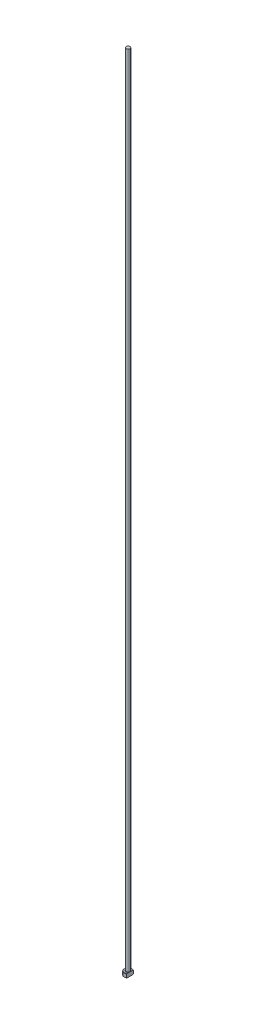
from build123d import *
from build123d.topology import SkipClean

# Parameters (mm, degrees)
CHAMFER1_SIZE = 0.2
FILLET1_R     = 0.2
KEY_DEPTH     = 631.014285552


with BuildPart() as part:
    # Sketch1 → Revolve1 (revolve)
    with BuildSketch(Plane.XY, mode=Mode.PRIVATE) as revolve1_sk:
        Polygon((0, 0), (-3, 0), (-3, 3), (-1.5, 3), (-1.5, 630), (0, 630), align=None)
    revolve(revolve1_sk.sketch.rotate(Axis((0, 259.958771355, 0), (0, -1, 0)), 270), axis=Axis((0, 259.958771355, 0), (0, -1, 0)))

    # Chamfer1
    chamfer1_edges = [part.edges().sort_by_distance(p)[0] for p in [
        (0, 3, -3),
        (0, 0, -3),
    ]]
    chamfer(chamfer1_edges, length=CHAMFER1_SIZE)

    # Fillet1
    fillet1_edges = [part.edges().sort_by_distance(p)[0] for p in [
        (0, 3, -1.5),
    ]]
    fillet(fillet1_edges, radius=FILLET1_R)

    # Sketch2 → KEY (cut, through all)
    with SkipClean():  # the faces are left unmerged after this step: merging them gives an invalid solid
        with BuildSketch(Plane(origin=(0, 0, 0), x_dir=(1, 0, 0), z_dir=(0, 1, 0))):
            with BuildLine():
                Line((1.5, 2.598076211), (1.5, -2.598076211))
                ThreePointArc((1.5, -2.598076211), (3, 0), (1.5, 2.598076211))
            make_face()
        extrude(amount=KEY_DEPTH, mode=Mode.SUBTRACT)


solid = part.part
